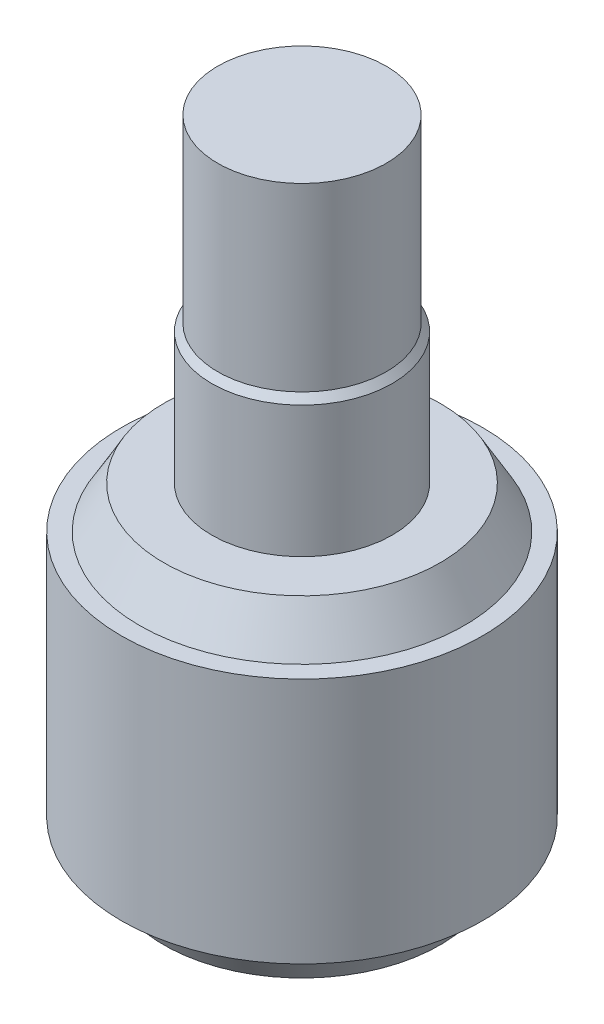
ISO-10303-21;
HEADER;
FILE_DESCRIPTION(('STEP AP214'),'2;1');
FILE_NAME('part.step','',(''),(''),'','','');
FILE_SCHEMA(('AUTOMOTIVE_DESIGN { 1 0 10303 214 1 1 1 1 }'));
ENDSEC;
DATA;
#1=APPLICATION_CONTEXT('core data for automotive mechanical design processes');
#2=APPLICATION_PROTOCOL_DEFINITION('international standard','automotive_design',2000,#1);
#3=PRODUCT_CONTEXT('',#1,'mechanical');
#4=PRODUCT('Part','Part','',(#3));
#5=PRODUCT_RELATED_PRODUCT_CATEGORY('part','',(#4));
#6=PRODUCT_DEFINITION_FORMATION('','',#4);
#7=PRODUCT_DEFINITION_CONTEXT('part definition',#1,'design');
#8=PRODUCT_DEFINITION('design','',#6,#7);
#9=PRODUCT_DEFINITION_SHAPE('','',#8);
#10=(LENGTH_UNIT() NAMED_UNIT(*) SI_UNIT(.MILLI.,.METRE.));
#11=(NAMED_UNIT(*) PLANE_ANGLE_UNIT() SI_UNIT($,.RADIAN.));
#12=(NAMED_UNIT(*) SI_UNIT($,.STERADIAN.) SOLID_ANGLE_UNIT());
#13=UNCERTAINTY_MEASURE_WITH_UNIT(LENGTH_MEASURE(1.E-05),#10,'distance_accuracy_value','');
#14=(GEOMETRIC_REPRESENTATION_CONTEXT(3) GLOBAL_UNCERTAINTY_ASSIGNED_CONTEXT((#13)) GLOBAL_UNIT_ASSIGNED_CONTEXT((#10,
#11,#12)) REPRESENTATION_CONTEXT('',''));
#15=CARTESIAN_POINT('',(0.,0.,0.));
#16=DIRECTION('',(0.,0.,1.));
#17=DIRECTION('',(1.,0.,0.));
#18=AXIS2_PLACEMENT_3D('',#15,#16,#17);
#19=CARTESIAN_POINT('',(0.,0.,0.));
#20=DIRECTION('',(0.,1.,0.));
#21=DIRECTION('',(0.,0.,1.));
#22=AXIS2_PLACEMENT_3D('',#19,#20,#21);
#23=CONICAL_SURFACE('',#22,2.29585481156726,0.523598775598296);
#24=CARTESIAN_POINT('',(0.,0.700000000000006,0.));
#25=DIRECTION('',(0.,-1.,0.));
#26=DIRECTION('',(0.,0.,-1.));
#27=AXIS2_PLACEMENT_3D('',#24,#25,#26);
#28=CIRCLE('',#27,2.7);
#29=CARTESIAN_POINT('',(0.,0.700000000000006,-2.7));
#30=VERTEX_POINT('',#29);
#31=EDGE_CURVE('E10',#30,#30,#28,.T.);
#32=ORIENTED_EDGE('',*,*,#31,.T.);
#33=EDGE_LOOP('',(#32));
#34=FACE_BOUND('',#33,.T.);
#35=CARTESIAN_POINT('',(0.,0.,0.));
#36=DIRECTION('',(0.,-1.,0.));
#37=DIRECTION('',(0.,0.,-1.));
#38=AXIS2_PLACEMENT_3D('',#35,#36,#37);
#39=CIRCLE('',#38,2.29585481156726);
#40=CARTESIAN_POINT('',(0.,0.,-2.29585481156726));
#41=VERTEX_POINT('',#40);
#42=EDGE_CURVE('E62',#41,#41,#39,.T.);
#43=ORIENTED_EDGE('',*,*,#42,.F.);
#44=EDGE_LOOP('',(#43));
#45=FACE_BOUND('',#44,.T.);
#46=ADVANCED_FACE('F28',(#34,#45),#23,.T.);
#47=CARTESIAN_POINT('',(2.7,0.700000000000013,0.));
#48=DIRECTION('',(0.,-1.,0.));
#49=DIRECTION('',(0.,0.,-1.));
#50=AXIS2_PLACEMENT_3D('',#47,#48,#49);
#51=PLANE('',#50);
#52=CARTESIAN_POINT('',(0.,0.700000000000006,0.));
#53=DIRECTION('',(0.,-1.,0.));
#54=DIRECTION('',(0.,0.,-1.));
#55=AXIS2_PLACEMENT_3D('',#52,#53,#54);
#56=CIRCLE('',#55,3.);
#57=CARTESIAN_POINT('',(0.,0.700000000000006,-3.));
#58=VERTEX_POINT('',#57);
#59=EDGE_CURVE('E34',#58,#58,#56,.T.);
#60=ORIENTED_EDGE('',*,*,#59,.T.);
#61=EDGE_LOOP('',(#60));
#62=FACE_BOUND('',#61,.T.);
#63=ORIENTED_EDGE('',*,*,#31,.F.);
#64=EDGE_LOOP('',(#63));
#65=FACE_BOUND('',#64,.T.);
#66=ADVANCED_FACE('F69',(#62,#65),#51,.T.);
#67=CARTESIAN_POINT('',(0.,0.,0.));
#68=DIRECTION('',(0.,-1.,0.));
#69=DIRECTION('',(0.,0.,-1.));
#70=AXIS2_PLACEMENT_3D('',#67,#68,#69);
#71=CYLINDRICAL_SURFACE('',#70,3.);
#72=CARTESIAN_POINT('',(0.,4.80000000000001,0.));
#73=DIRECTION('',(0.,-1.,0.));
#74=DIRECTION('',(0.,0.,-1.));
#75=AXIS2_PLACEMENT_3D('',#72,#73,#74);
#76=CIRCLE('',#75,3.);
#77=CARTESIAN_POINT('',(0.,4.80000000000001,-3.));
#78=VERTEX_POINT('',#77);
#79=EDGE_CURVE('E38',#78,#78,#76,.T.);
#80=ORIENTED_EDGE('',*,*,#79,.T.);
#81=EDGE_LOOP('',(#80));
#82=FACE_BOUND('',#81,.T.);
#83=ORIENTED_EDGE('',*,*,#59,.F.);
#84=EDGE_LOOP('',(#83));
#85=FACE_BOUND('',#84,.T.);
#86=ADVANCED_FACE('F73',(#82,#85),#71,.T.);
#87=CARTESIAN_POINT('',(3.00000000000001,4.80000000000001,0.));
#88=DIRECTION('',(0.,1.,0.));
#89=DIRECTION('',(0.,0.,1.));
#90=AXIS2_PLACEMENT_3D('',#87,#88,#89);
#91=PLANE('',#90);
#92=CARTESIAN_POINT('',(0.,4.80000000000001,0.));
#93=DIRECTION('',(0.,-1.,0.));
#94=DIRECTION('',(0.,0.,-1.));
#95=AXIS2_PLACEMENT_3D('',#92,#93,#94);
#96=CIRCLE('',#95,2.7);
#97=CARTESIAN_POINT('',(0.,4.80000000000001,-2.7));
#98=VERTEX_POINT('',#97);
#99=EDGE_CURVE('E42',#98,#98,#96,.T.);
#100=ORIENTED_EDGE('',*,*,#99,.T.);
#101=EDGE_LOOP('',(#100));
#102=FACE_BOUND('',#101,.T.);
#103=ORIENTED_EDGE('',*,*,#79,.F.);
#104=EDGE_LOOP('',(#103));
#105=FACE_BOUND('',#104,.T.);
#106=ADVANCED_FACE('F77',(#102,#105),#91,.T.);
#107=CARTESIAN_POINT('',(0.,4.80000000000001,0.));
#108=DIRECTION('',(0.,-1.,0.));
#109=DIRECTION('',(0.,0.,-1.));
#110=AXIS2_PLACEMENT_3D('',#107,#108,#109);
#111=CONICAL_SURFACE('',#110,2.7,0.523598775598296);
#112=CARTESIAN_POINT('',(0.,5.50000000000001,0.));
#113=DIRECTION('',(0.,-1.,0.));
#114=DIRECTION('',(0.,0.,-1.));
#115=AXIS2_PLACEMENT_3D('',#112,#113,#114);
#116=CIRCLE('',#115,2.29585481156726);
#117=CARTESIAN_POINT('',(0.,5.50000000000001,-2.29585481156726));
#118=VERTEX_POINT('',#117);
#119=EDGE_CURVE('E47',#118,#118,#116,.T.);
#120=ORIENTED_EDGE('',*,*,#119,.T.);
#121=EDGE_LOOP('',(#120));
#122=FACE_BOUND('',#121,.T.);
#123=ORIENTED_EDGE('',*,*,#99,.F.);
#124=EDGE_LOOP('',(#123));
#125=FACE_BOUND('',#124,.T.);
#126=ADVANCED_FACE('F84',(#122,#125),#111,.T.);
#127=CARTESIAN_POINT('',(2.29585481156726,5.50000000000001,0.));
#128=DIRECTION('',(0.,1.,0.));
#129=DIRECTION('',(0.,0.,1.));
#130=AXIS2_PLACEMENT_3D('',#127,#128,#129);
#131=PLANE('',#130);
#132=CARTESIAN_POINT('',(0.,5.50000000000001,0.));
#133=DIRECTION('',(0.,-1.,0.));
#134=DIRECTION('',(0.,0.,-1.));
#135=AXIS2_PLACEMENT_3D('',#132,#133,#134);
#136=CIRCLE('',#135,1.5);
#137=CARTESIAN_POINT('',(0.,5.50000000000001,-1.5));
#138=VERTEX_POINT('',#137);
#139=EDGE_CURVE('E50',#138,#138,#136,.T.);
#140=ORIENTED_EDGE('',*,*,#139,.T.);
#141=EDGE_LOOP('',(#140));
#142=FACE_BOUND('',#141,.T.);
#143=ORIENTED_EDGE('',*,*,#119,.F.);
#144=EDGE_LOOP('',(#143));
#145=FACE_BOUND('',#144,.T.);
#146=ADVANCED_FACE('F88',(#142,#145),#131,.T.);
#147=CARTESIAN_POINT('',(0.,0.,0.));
#148=DIRECTION('',(0.,-1.,0.));
#149=DIRECTION('',(0.,0.,-1.));
#150=AXIS2_PLACEMENT_3D('',#147,#148,#149);
#151=CYLINDRICAL_SURFACE('',#150,1.5);
#152=CARTESIAN_POINT('',(0.,7.68082464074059,0.));
#153=DIRECTION('',(0.,-1.,0.));
#154=DIRECTION('',(0.,0.,-1.));
#155=AXIS2_PLACEMENT_3D('',#152,#153,#154);
#156=CIRCLE('',#155,1.5);
#157=CARTESIAN_POINT('',(0.,7.68082464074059,-1.5));
#158=VERTEX_POINT('',#157);
#159=EDGE_CURVE('E53',#158,#158,#156,.T.);
#160=ORIENTED_EDGE('',*,*,#159,.T.);
#161=EDGE_LOOP('',(#160));
#162=FACE_BOUND('',#161,.T.);
#163=ORIENTED_EDGE('',*,*,#139,.F.);
#164=EDGE_LOOP('',(#163));
#165=FACE_BOUND('',#164,.T.);
#166=ADVANCED_FACE('F92',(#162,#165),#151,.T.);
#167=CARTESIAN_POINT('',(0.,7.68082464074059,0.));
#168=DIRECTION('',(0.,-1.,0.));
#169=DIRECTION('',(0.,0.,-1.));
#170=AXIS2_PLACEMENT_3D('',#167,#168,#169);
#171=CONICAL_SURFACE('',#170,1.5,0.698131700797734);
#172=CARTESIAN_POINT('',(0.,7.80000000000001,0.));
#173=DIRECTION('',(0.,-1.,0.));
#174=DIRECTION('',(0.,0.,-1.));
#175=AXIS2_PLACEMENT_3D('',#172,#173,#174);
#176=CIRCLE('',#175,1.4);
#177=CARTESIAN_POINT('',(0.,7.80000000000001,-1.4));
#178=VERTEX_POINT('',#177);
#179=EDGE_CURVE('E56',#178,#178,#176,.T.);
#180=ORIENTED_EDGE('',*,*,#179,.T.);
#181=EDGE_LOOP('',(#180));
#182=FACE_BOUND('',#181,.T.);
#183=ORIENTED_EDGE('',*,*,#159,.F.);
#184=EDGE_LOOP('',(#183));
#185=FACE_BOUND('',#184,.T.);
#186=ADVANCED_FACE('F96',(#182,#185),#171,.T.);
#187=CARTESIAN_POINT('',(0.,0.,0.));
#188=DIRECTION('',(0.,-1.,0.));
#189=DIRECTION('',(0.,0.,-1.));
#190=AXIS2_PLACEMENT_3D('',#187,#188,#189);
#191=CYLINDRICAL_SURFACE('',#190,1.4);
#192=CARTESIAN_POINT('',(0.,10.8,0.));
#193=DIRECTION('',(0.,-1.,0.));
#194=DIRECTION('',(0.,0.,-1.));
#195=AXIS2_PLACEMENT_3D('',#192,#193,#194);
#196=CIRCLE('',#195,1.4);
#197=CARTESIAN_POINT('',(0.,10.8,-1.40000000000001));
#198=VERTEX_POINT('',#197);
#199=EDGE_CURVE('E59',#198,#198,#196,.T.);
#200=ORIENTED_EDGE('',*,*,#199,.T.);
#201=EDGE_LOOP('',(#200));
#202=FACE_BOUND('',#201,.T.);
#203=ORIENTED_EDGE('',*,*,#179,.F.);
#204=EDGE_LOOP('',(#203));
#205=FACE_BOUND('',#204,.T.);
#206=ADVANCED_FACE('F100',(#202,#205),#191,.T.);
#207=CARTESIAN_POINT('',(1.40000000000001,10.8,0.));
#208=DIRECTION('',(0.,1.,0.));
#209=DIRECTION('',(0.,0.,1.));
#210=AXIS2_PLACEMENT_3D('',#207,#208,#209);
#211=PLANE('',#210);
#212=ORIENTED_EDGE('',*,*,#199,.F.);
#213=EDGE_LOOP('',(#212));
#214=FACE_BOUND('',#213,.T.);
#215=ADVANCED_FACE('F104',(#214),#211,.T.);
#216=CARTESIAN_POINT('',(0.,0.,0.));
#217=DIRECTION('',(0.,-1.,0.));
#218=DIRECTION('',(0.,0.,-1.));
#219=AXIS2_PLACEMENT_3D('',#216,#217,#218);
#220=PLANE('',#219);
#221=ORIENTED_EDGE('',*,*,#42,.T.);
#222=EDGE_LOOP('',(#221));
#223=FACE_BOUND('',#222,.T.);
#224=ADVANCED_FACE('F66',(#223),#220,.T.);
#225=CLOSED_SHELL('',(#46,#66,#86,#106,#126,#146,#166,#186,#206,#215,#224));
#226=MANIFOLD_SOLID_BREP('B2',#225);
#227=ADVANCED_BREP_SHAPE_REPRESENTATION('',(#18,#226),#14);
#228=SHAPE_DEFINITION_REPRESENTATION(#9,#227);
ENDSEC;
END-ISO-10303-21;
